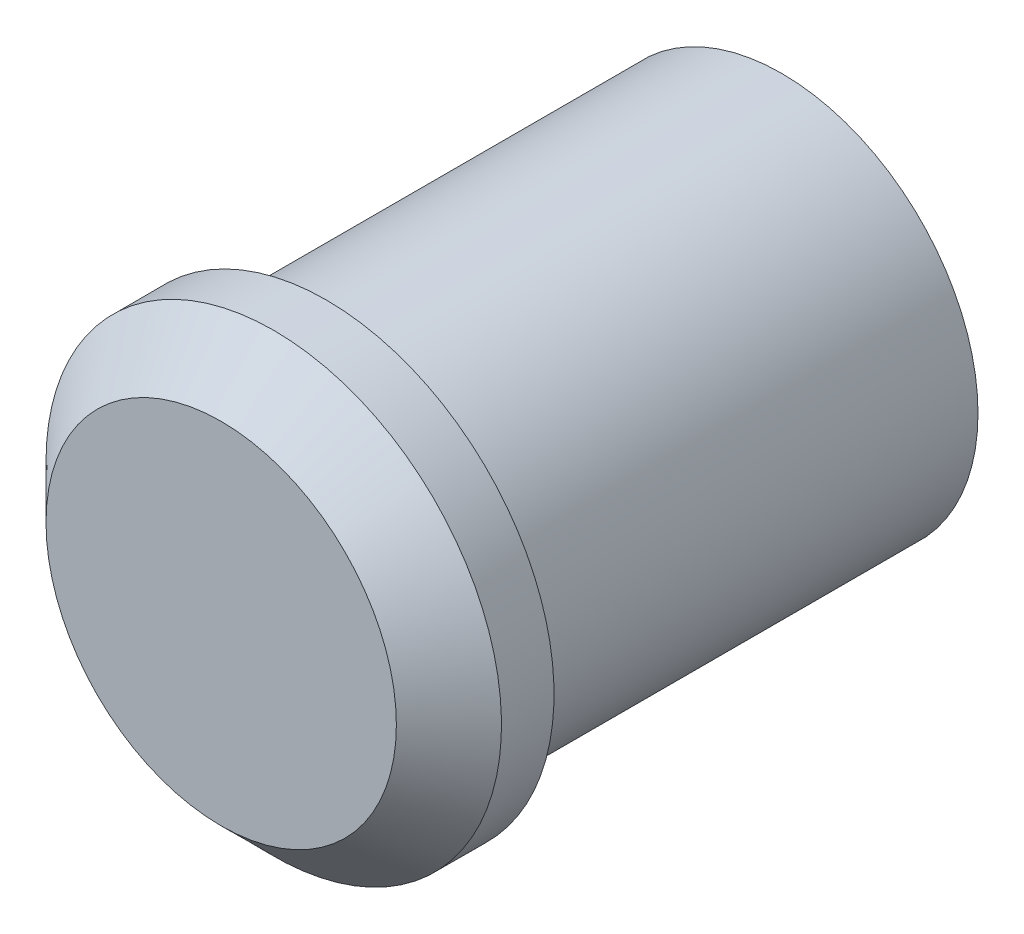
ISO-10303-21;
HEADER;
FILE_DESCRIPTION(('STEP AP214'),'2;1');
FILE_NAME('part.step','',(''),(''),'','','');
FILE_SCHEMA(('AUTOMOTIVE_DESIGN { 1 0 10303 214 1 1 1 1 }'));
ENDSEC;
DATA;
#1=APPLICATION_CONTEXT('core data for automotive mechanical design processes');
#2=APPLICATION_PROTOCOL_DEFINITION('international standard','automotive_design',2000,#1);
#3=PRODUCT_CONTEXT('',#1,'mechanical');
#4=PRODUCT('Part','Part','',(#3));
#5=PRODUCT_RELATED_PRODUCT_CATEGORY('part','',(#4));
#6=PRODUCT_DEFINITION_FORMATION('','',#4);
#7=PRODUCT_DEFINITION_CONTEXT('part definition',#1,'design');
#8=PRODUCT_DEFINITION('design','',#6,#7);
#9=PRODUCT_DEFINITION_SHAPE('','',#8);
#10=(LENGTH_UNIT() NAMED_UNIT(*) SI_UNIT(.MILLI.,.METRE.));
#11=(NAMED_UNIT(*) PLANE_ANGLE_UNIT() SI_UNIT($,.RADIAN.));
#12=(NAMED_UNIT(*) SI_UNIT($,.STERADIAN.) SOLID_ANGLE_UNIT());
#13=UNCERTAINTY_MEASURE_WITH_UNIT(LENGTH_MEASURE(1.E-05),#10,'distance_accuracy_value','');
#14=(GEOMETRIC_REPRESENTATION_CONTEXT(3) GLOBAL_UNCERTAINTY_ASSIGNED_CONTEXT((#13)) GLOBAL_UNIT_ASSIGNED_CONTEXT((#10,
#11,#12)) REPRESENTATION_CONTEXT('',''));
#15=CARTESIAN_POINT('',(0.,0.,0.));
#16=DIRECTION('',(0.,0.,1.));
#17=DIRECTION('',(1.,0.,0.));
#18=AXIS2_PLACEMENT_3D('',#15,#16,#17);
#19=CARTESIAN_POINT('',(0.,5.,37.2619999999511));
#20=DIRECTION('',(0.,0.,1.));
#21=DIRECTION('',(0.,-1.,0.));
#22=AXIS2_PLACEMENT_3D('',#19,#20,#21);
#23=PLANE('',#22);
#24=CARTESIAN_POINT('',(0.,5.,37.2619999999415));
#25=DIRECTION('',(0.,0.,-1.));
#26=DIRECTION('',(-1.,0.,0.));
#27=AXIS2_PLACEMENT_3D('',#24,#25,#26);
#28=CIRCLE('',#27,1.27000000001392);
#29=CARTESIAN_POINT('',(-1.27000000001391,5.,37.2619999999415));
#30=VERTEX_POINT('',#29);
#31=EDGE_CURVE('E18',#30,#30,#28,.T.);
#32=ORIENTED_EDGE('',*,*,#31,.F.);
#33=EDGE_LOOP('',(#32));
#34=FACE_BOUND('',#33,.T.);
#35=ADVANCED_FACE('F15',(#34),#23,.T.);
#36=CARTESIAN_POINT('',(0.,5.,36.8810000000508));
#37=DIRECTION('',(0.,0.,-1.));
#38=DIRECTION('',(-1.,0.,0.));
#39=AXIS2_PLACEMENT_3D('',#36,#37,#38);
#40=CONICAL_SURFACE('',#39,1.65099999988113,0.785398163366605);
#41=ORIENTED_EDGE('',*,*,#31,.T.);
#42=EDGE_LOOP('',(#41));
#43=FACE_BOUND('',#42,.T.);
#44=CARTESIAN_POINT('',(0.,5.,36.880999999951));
#45=DIRECTION('',(0.,0.,-1.));
#46=DIRECTION('',(0.,1.,0.));
#47=AXIS2_PLACEMENT_3D('',#44,#45,#46);
#48=CIRCLE('',#47,1.651);
#49=CARTESIAN_POINT('',(0.,6.651,36.880999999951));
#50=VERTEX_POINT('',#49);
#51=EDGE_CURVE('E30',#50,#50,#48,.T.);
#52=ORIENTED_EDGE('',*,*,#51,.F.);
#53=EDGE_LOOP('',(#52));
#54=FACE_BOUND('',#53,.T.);
#55=ADVANCED_FACE('F40',(#43,#54),#40,.T.);
#56=CARTESIAN_POINT('',(0.,5.,37.2619999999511));
#57=DIRECTION('',(0.,0.,-1.));
#58=DIRECTION('',(0.,1.,0.));
#59=AXIS2_PLACEMENT_3D('',#56,#57,#58);
#60=CYLINDRICAL_SURFACE('',#59,1.651);
#61=ORIENTED_EDGE('',*,*,#51,.T.);
#62=EDGE_LOOP('',(#61));
#63=FACE_BOUND('',#62,.T.);
#64=CARTESIAN_POINT('',(0.,5.,36.4999999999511));
#65=DIRECTION('',(0.,0.,-1.));
#66=DIRECTION('',(0.,1.,0.));
#67=AXIS2_PLACEMENT_3D('',#64,#65,#66);
#68=CIRCLE('',#67,1.651);
#69=CARTESIAN_POINT('',(0.,6.651,36.4999999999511));
#70=VERTEX_POINT('',#69);
#71=EDGE_CURVE('E27',#70,#70,#68,.F.);
#72=ORIENTED_EDGE('',*,*,#71,.T.);
#73=EDGE_LOOP('',(#72));
#74=FACE_BOUND('',#73,.T.);
#75=ADVANCED_FACE('F47',(#63,#74),#60,.T.);
#76=CARTESIAN_POINT('',(0.,5.,36.4999999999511));
#77=DIRECTION('',(0.,0.,1.));
#78=DIRECTION('',(0.,-1.,0.));
#79=AXIS2_PLACEMENT_3D('',#76,#77,#78);
#80=PLANE('',#79);
#81=ORIENTED_EDGE('',*,*,#71,.F.);
#82=EDGE_LOOP('',(#81));
#83=FACE_BOUND('',#82,.T.);
#84=CARTESIAN_POINT('',(0.,5.,36.4999999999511));
#85=DIRECTION('',(0.,0.,-1.));
#86=DIRECTION('',(0.,1.,0.));
#87=AXIS2_PLACEMENT_3D('',#84,#85,#86);
#88=CIRCLE('',#87,1.42240000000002);
#89=CARTESIAN_POINT('',(0.,6.42240000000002,36.4999999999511));
#90=VERTEX_POINT('',#89);
#91=EDGE_CURVE('E22',#90,#90,#88,.T.);
#92=ORIENTED_EDGE('',*,*,#91,.F.);
#93=EDGE_LOOP('',(#92));
#94=FACE_BOUND('',#93,.T.);
#95=ADVANCED_FACE('F56',(#83,#94),#80,.F.);
#96=CARTESIAN_POINT('',(0.,5.,33.197999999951));
#97=DIRECTION('',(0.,0.,1.));
#98=DIRECTION('',(0.,-1.,0.));
#99=AXIS2_PLACEMENT_3D('',#96,#97,#98);
#100=PLANE('',#99);
#101=CARTESIAN_POINT('',(0.,5.,33.197999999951));
#102=DIRECTION('',(0.,0.,-1.));
#103=DIRECTION('',(0.,1.,0.));
#104=AXIS2_PLACEMENT_3D('',#101,#102,#103);
#105=CIRCLE('',#104,1.42240000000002);
#106=CARTESIAN_POINT('',(0.,6.42240000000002,33.197999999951));
#107=VERTEX_POINT('',#106);
#108=EDGE_CURVE('E9',#107,#107,#105,.F.);
#109=ORIENTED_EDGE('',*,*,#108,.F.);
#110=EDGE_LOOP('',(#109));
#111=FACE_BOUND('',#110,.T.);
#112=ADVANCED_FACE('F50',(#111),#100,.F.);
#113=CARTESIAN_POINT('',(0.,5.,36.4999999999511));
#114=DIRECTION('',(0.,0.,-1.));
#115=DIRECTION('',(0.,1.,0.));
#116=AXIS2_PLACEMENT_3D('',#113,#114,#115);
#117=CYLINDRICAL_SURFACE('',#116,1.42240000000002);
#118=ORIENTED_EDGE('',*,*,#91,.T.);
#119=EDGE_LOOP('',(#118));
#120=FACE_BOUND('',#119,.T.);
#121=ORIENTED_EDGE('',*,*,#108,.T.);
#122=EDGE_LOOP('',(#121));
#123=FACE_BOUND('',#122,.T.);
#124=ADVANCED_FACE('F48',(#120,#123),#117,.T.);
#125=CLOSED_SHELL('',(#35,#55,#75,#95,#112,#124));
#126=MANIFOLD_SOLID_BREP('B1',#125);
#127=ADVANCED_BREP_SHAPE_REPRESENTATION('',(#18,#126),#14);
#128=SHAPE_DEFINITION_REPRESENTATION(#9,#127);
ENDSEC;
END-ISO-10303-21;
